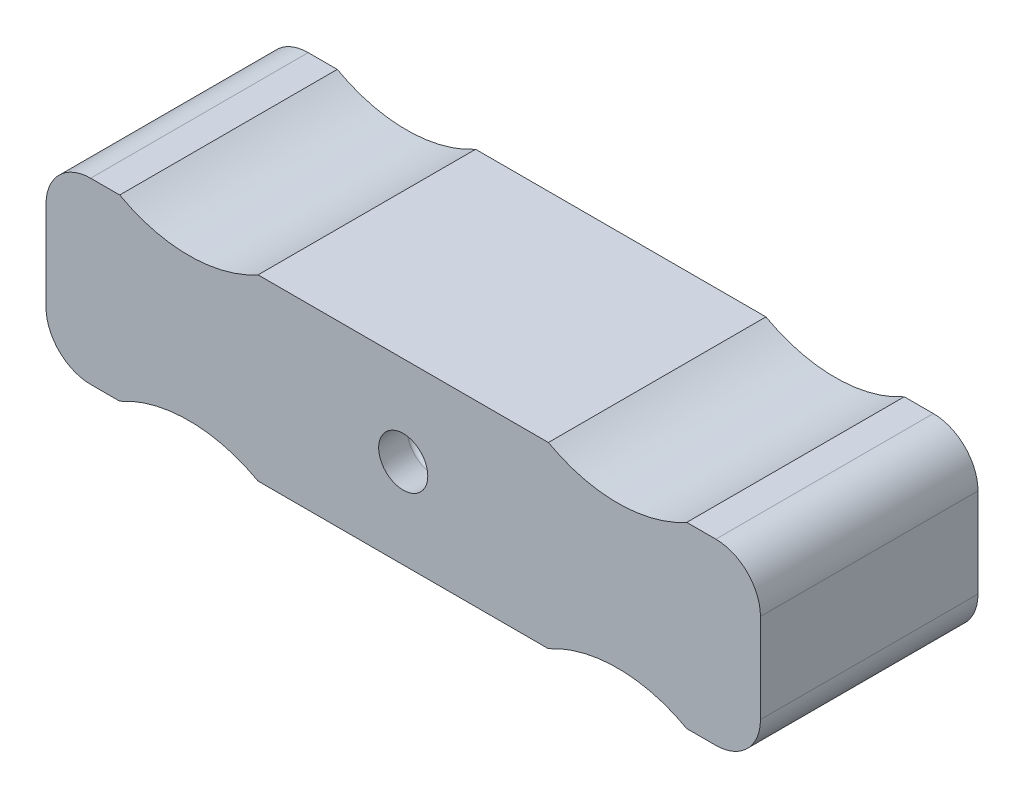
ISO-10303-21;
HEADER;
FILE_DESCRIPTION(('STEP AP214'),'2;1');
FILE_NAME('part.step','',(''),(''),'','','');
FILE_SCHEMA(('AUTOMOTIVE_DESIGN { 1 0 10303 214 1 1 1 1 }'));
ENDSEC;
DATA;
#1=APPLICATION_CONTEXT('core data for automotive mechanical design processes');
#2=APPLICATION_PROTOCOL_DEFINITION('international standard','automotive_design',2000,#1);
#3=PRODUCT_CONTEXT('',#1,'mechanical');
#4=PRODUCT('Part','Part','',(#3));
#5=PRODUCT_RELATED_PRODUCT_CATEGORY('part','',(#4));
#6=PRODUCT_DEFINITION_FORMATION('','',#4);
#7=PRODUCT_DEFINITION_CONTEXT('part definition',#1,'design');
#8=PRODUCT_DEFINITION('design','',#6,#7);
#9=PRODUCT_DEFINITION_SHAPE('','',#8);
#10=(LENGTH_UNIT() NAMED_UNIT(*) SI_UNIT(.MILLI.,.METRE.));
#11=(NAMED_UNIT(*) PLANE_ANGLE_UNIT() SI_UNIT($,.RADIAN.));
#12=(NAMED_UNIT(*) SI_UNIT($,.STERADIAN.) SOLID_ANGLE_UNIT());
#13=UNCERTAINTY_MEASURE_WITH_UNIT(LENGTH_MEASURE(1.E-05),#10,'distance_accuracy_value','');
#14=(GEOMETRIC_REPRESENTATION_CONTEXT(3) GLOBAL_UNCERTAINTY_ASSIGNED_CONTEXT((#13)) GLOBAL_UNIT_ASSIGNED_CONTEXT((#10,
#11,#12)) REPRESENTATION_CONTEXT('',''));
#15=CARTESIAN_POINT('',(0.,0.,0.));
#16=DIRECTION('',(0.,0.,1.));
#17=DIRECTION('',(1.,0.,0.));
#18=AXIS2_PLACEMENT_3D('',#15,#16,#17);
#19=CARTESIAN_POINT('',(63.0000000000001,100.,-20.));
#20=DIRECTION('',(0.,0.,1.));
#21=DIRECTION('',(1.,0.,0.));
#22=AXIS2_PLACEMENT_3D('',#19,#20,#21);
#23=PLANE('',#22);
#24=CARTESIAN_POINT('',(110.5,105.,-20.));
#25=DIRECTION('',(0.,0.,-1.));
#26=DIRECTION('',(-1.,0.,0.));
#27=AXIS2_PLACEMENT_3D('',#24,#25,#26);
#28=CIRCLE('',#27,3.);
#29=CARTESIAN_POINT('',(107.5,105.,-20.));
#30=VERTEX_POINT('',#29);
#31=EDGE_CURVE('E183',#30,#30,#28,.T.);
#32=ORIENTED_EDGE('',*,*,#31,.F.);
#33=EDGE_LOOP('',(#32));
#34=FACE_BOUND('',#33,.T.);
#35=CARTESIAN_POINT('',(63.0000000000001,100.,-20.));
#36=DIRECTION('',(0.,0.,1.));
#37=DIRECTION('',(1.,0.,0.));
#38=AXIS2_PLACEMENT_3D('',#35,#36,#37);
#39=CIRCLE('',#38,5.);
#40=CARTESIAN_POINT('',(58.0000000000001,100.,-20.));
#41=VERTEX_POINT('',#40);
#42=CARTESIAN_POINT('',(63.0000000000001,95.0000000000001,-20.));
#43=VERTEX_POINT('',#42);
#44=EDGE_CURVE('E235',#41,#43,#39,.T.);
#45=ORIENTED_EDGE('',*,*,#44,.F.);
#46=DIRECTION('',(0.,-1.,0.));
#47=VECTOR('',#46,1.);
#48=CARTESIAN_POINT('',(58.0000000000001,110.,-20.));
#49=LINE('',#48,#47);
#50=CARTESIAN_POINT('',(58.0000000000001,110.,-20.));
#51=VERTEX_POINT('',#50);
#52=EDGE_CURVE('E279',#51,#41,#49,.T.);
#53=ORIENTED_EDGE('',*,*,#52,.F.);
#54=CARTESIAN_POINT('',(63.0000000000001,110.,-20.));
#55=DIRECTION('',(0.,0.,1.));
#56=DIRECTION('',(1.,0.,0.));
#57=AXIS2_PLACEMENT_3D('',#54,#55,#56);
#58=CIRCLE('',#57,5.);
#59=CARTESIAN_POINT('',(63.0000000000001,115.,-20.));
#60=VERTEX_POINT('',#59);
#61=EDGE_CURVE('E277',#60,#51,#58,.T.);
#62=ORIENTED_EDGE('',*,*,#61,.F.);
#63=DIRECTION('',(-1.,0.,0.));
#64=VECTOR('',#63,1.);
#65=CARTESIAN_POINT('',(66.2540333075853,115.,-20.));
#66=LINE('',#65,#64);
#67=CARTESIAN_POINT('',(66.2540333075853,115.,-20.));
#68=VERTEX_POINT('',#67);
#69=EDGE_CURVE('E274',#68,#60,#66,.T.);
#70=ORIENTED_EDGE('',*,*,#69,.F.);
#71=CARTESIAN_POINT('',(74.,129.,-20.));
#72=DIRECTION('',(0.,0.,-1.));
#73=DIRECTION('',(1.,0.,0.));
#74=AXIS2_PLACEMENT_3D('',#71,#72,#73);
#75=CIRCLE('',#74,16.);
#76=CARTESIAN_POINT('',(81.7459666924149,115.,-20.));
#77=VERTEX_POINT('',#76);
#78=EDGE_CURVE('E271',#77,#68,#75,.T.);
#79=ORIENTED_EDGE('',*,*,#78,.F.);
#80=DIRECTION('',(-1.,0.,0.));
#81=VECTOR('',#80,1.);
#82=CARTESIAN_POINT('',(114.254033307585,115.,-20.));
#83=LINE('',#82,#81);
#84=CARTESIAN_POINT('',(114.254033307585,115.,-20.));
#85=VERTEX_POINT('',#84);
#86=EDGE_CURVE('E268',#85,#77,#83,.T.);
#87=ORIENTED_EDGE('',*,*,#86,.F.);
#88=CARTESIAN_POINT('',(122.,129.,-20.));
#89=DIRECTION('',(0.,0.,-1.));
#90=DIRECTION('',(1.,0.,0.));
#91=AXIS2_PLACEMENT_3D('',#88,#89,#90);
#92=CIRCLE('',#91,16.);
#93=CARTESIAN_POINT('',(129.745966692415,115.,-20.));
#94=VERTEX_POINT('',#93);
#95=EDGE_CURVE('E265',#94,#85,#92,.T.);
#96=ORIENTED_EDGE('',*,*,#95,.F.);
#97=DIRECTION('',(-1.,0.,0.));
#98=VECTOR('',#97,1.);
#99=CARTESIAN_POINT('',(133.,115.,-20.));
#100=LINE('',#99,#98);
#101=CARTESIAN_POINT('',(133.,115.,-20.));
#102=VERTEX_POINT('',#101);
#103=EDGE_CURVE('E262',#102,#94,#100,.T.);
#104=ORIENTED_EDGE('',*,*,#103,.F.);
#105=CARTESIAN_POINT('',(133.,110.,-20.));
#106=DIRECTION('',(0.,0.,1.));
#107=DIRECTION('',(1.,0.,0.));
#108=AXIS2_PLACEMENT_3D('',#105,#106,#107);
#109=CIRCLE('',#108,5.00000000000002);
#110=CARTESIAN_POINT('',(138.,110.,-20.));
#111=VERTEX_POINT('',#110);
#112=EDGE_CURVE('E259',#111,#102,#109,.T.);
#113=ORIENTED_EDGE('',*,*,#112,.F.);
#114=DIRECTION('',(0.,1.,0.));
#115=VECTOR('',#114,1.);
#116=CARTESIAN_POINT('',(138.,100.,-20.));
#117=LINE('',#116,#115);
#118=CARTESIAN_POINT('',(138.,100.,-20.));
#119=VERTEX_POINT('',#118);
#120=EDGE_CURVE('E256',#119,#111,#117,.T.);
#121=ORIENTED_EDGE('',*,*,#120,.F.);
#122=CARTESIAN_POINT('',(133.,100.,-20.));
#123=DIRECTION('',(0.,0.,1.));
#124=DIRECTION('',(1.,0.,0.));
#125=AXIS2_PLACEMENT_3D('',#122,#123,#124);
#126=CIRCLE('',#125,5.00000000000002);
#127=CARTESIAN_POINT('',(133.,95.0000000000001,-20.));
#128=VERTEX_POINT('',#127);
#129=EDGE_CURVE('E253',#128,#119,#126,.T.);
#130=ORIENTED_EDGE('',*,*,#129,.F.);
#131=DIRECTION('',(1.,0.,0.));
#132=VECTOR('',#131,1.);
#133=CARTESIAN_POINT('',(129.745966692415,95.0000000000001,-20.));
#134=LINE('',#133,#132);
#135=CARTESIAN_POINT('',(129.745966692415,95.0000000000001,-20.));
#136=VERTEX_POINT('',#135);
#137=EDGE_CURVE('E250',#136,#128,#134,.T.);
#138=ORIENTED_EDGE('',*,*,#137,.F.);
#139=CARTESIAN_POINT('',(122.,81.0000000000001,-20.));
#140=DIRECTION('',(0.,0.,-1.));
#141=DIRECTION('',(1.,0.,0.));
#142=AXIS2_PLACEMENT_3D('',#139,#140,#141);
#143=CIRCLE('',#142,16.);
#144=CARTESIAN_POINT('',(114.254033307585,95.0000000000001,-20.));
#145=VERTEX_POINT('',#144);
#146=EDGE_CURVE('E247',#145,#136,#143,.T.);
#147=ORIENTED_EDGE('',*,*,#146,.F.);
#148=DIRECTION('',(1.,0.,0.));
#149=VECTOR('',#148,1.);
#150=CARTESIAN_POINT('',(81.7459666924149,95.0000000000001,-20.));
#151=LINE('',#150,#149);
#152=CARTESIAN_POINT('',(81.7459666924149,95.0000000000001,-20.));
#153=VERTEX_POINT('',#152);
#154=EDGE_CURVE('E244',#153,#145,#151,.T.);
#155=ORIENTED_EDGE('',*,*,#154,.F.);
#156=CARTESIAN_POINT('',(74.,81.0000000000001,-20.));
#157=DIRECTION('',(0.,0.,-1.));
#158=DIRECTION('',(1.,0.,0.));
#159=AXIS2_PLACEMENT_3D('',#156,#157,#158);
#160=CIRCLE('',#159,16.);
#161=CARTESIAN_POINT('',(66.2540333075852,95.0000000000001,-20.));
#162=VERTEX_POINT('',#161);
#163=EDGE_CURVE('E241',#162,#153,#160,.T.);
#164=ORIENTED_EDGE('',*,*,#163,.F.);
#165=DIRECTION('',(1.,0.,0.));
#166=VECTOR('',#165,1.);
#167=CARTESIAN_POINT('',(63.0000000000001,95.0000000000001,-20.));
#168=LINE('',#167,#166);
#169=EDGE_CURVE('E238',#43,#162,#168,.T.);
#170=ORIENTED_EDGE('',*,*,#169,.F.);
#171=EDGE_LOOP('',(#45,#53,#62,#70,#79,#87,#96,#104,#113,#121,#130,#138,#147,#155,#164,#170));
#172=FACE_BOUND('',#171,.T.);
#173=CARTESIAN_POINT('',(98.0000000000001,105.,-20.));
#174=DIRECTION('',(0.,0.,1.));
#175=DIRECTION('',(1.,0.,0.));
#176=AXIS2_PLACEMENT_3D('',#173,#174,#175);
#177=CIRCLE('',#176,2.50000000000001);
#178=CARTESIAN_POINT('',(100.5,105.,-20.));
#179=VERTEX_POINT('',#178);
#180=EDGE_CURVE('E232',#179,#179,#177,.T.);
#181=ORIENTED_EDGE('',*,*,#180,.T.);
#182=EDGE_LOOP('',(#181));
#183=FACE_BOUND('',#182,.T.);
#184=CARTESIAN_POINT('',(85.5000000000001,105.,-20.));
#185=DIRECTION('',(0.,0.,-1.));
#186=DIRECTION('',(-1.,0.,0.));
#187=AXIS2_PLACEMENT_3D('',#184,#185,#186);
#188=CIRCLE('',#187,3.);
#189=CARTESIAN_POINT('',(82.5000000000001,105.,-20.));
#190=VERTEX_POINT('',#189);
#191=EDGE_CURVE('E171',#190,#190,#188,.T.);
#192=ORIENTED_EDGE('',*,*,#191,.F.);
#193=EDGE_LOOP('',(#192));
#194=FACE_BOUND('',#193,.T.);
#195=ADVANCED_FACE('F31',(#34,#172,#183,#194),#23,.F.);
#196=CARTESIAN_POINT('',(58.0000000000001,110.,86.8221125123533));
#197=DIRECTION('',(1.,0.,0.));
#198=DIRECTION('',(0.,0.,-1.));
#199=AXIS2_PLACEMENT_3D('',#196,#197,#198);
#200=PLANE('',#199);
#201=DIRECTION('',(0.,-1.,0.));
#202=VECTOR('',#201,1.);
#203=CARTESIAN_POINT('',(58.0000000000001,110.,4.36));
#204=LINE('',#203,#202);
#205=CARTESIAN_POINT('',(58.0000000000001,110.,4.36));
#206=VERTEX_POINT('',#205);
#207=CARTESIAN_POINT('',(58.,100.,4.36));
#208=VERTEX_POINT('',#207);
#209=EDGE_CURVE('E186',#206,#208,#204,.T.);
#210=ORIENTED_EDGE('',*,*,#209,.F.);
#211=DIRECTION('',(0.,0.,-1.));
#212=VECTOR('',#211,1.);
#213=CARTESIAN_POINT('',(58.0000000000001,110.,86.8221125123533));
#214=LINE('',#213,#212);
#215=EDGE_CURVE('E47',#206,#51,#214,.T.);
#216=ORIENTED_EDGE('',*,*,#215,.T.);
#217=ORIENTED_EDGE('',*,*,#52,.T.);
#218=DIRECTION('',(0.,0.,-1.));
#219=VECTOR('',#218,1.);
#220=CARTESIAN_POINT('',(58.0000000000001,100.,86.8221125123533));
#221=LINE('',#220,#219);
#222=EDGE_CURVE('E282',#208,#41,#221,.T.);
#223=ORIENTED_EDGE('',*,*,#222,.F.);
#224=EDGE_LOOP('',(#210,#216,#217,#223));
#225=FACE_BOUND('',#224,.T.);
#226=ADVANCED_FACE('F332',(#225),#200,.F.);
#227=CARTESIAN_POINT('',(63.,110.,86.8221125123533));
#228=DIRECTION('',(0.,0.,-1.));
#229=DIRECTION('',(-1.,0.,0.));
#230=AXIS2_PLACEMENT_3D('',#227,#228,#229);
#231=CYLINDRICAL_SURFACE('',#230,5.);
#232=CARTESIAN_POINT('',(63.0000000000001,110.,4.36000000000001));
#233=DIRECTION('',(0.,0.,1.));
#234=DIRECTION('',(1.,0.,0.));
#235=AXIS2_PLACEMENT_3D('',#232,#233,#234);
#236=CIRCLE('',#235,5.);
#237=CARTESIAN_POINT('',(63.0000000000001,115.,4.36000000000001));
#238=VERTEX_POINT('',#237);
#239=EDGE_CURVE('E189',#238,#206,#236,.T.);
#240=ORIENTED_EDGE('',*,*,#239,.F.);
#241=DIRECTION('',(0.,0.,-1.));
#242=VECTOR('',#241,1.);
#243=CARTESIAN_POINT('',(63.,115.,86.8221125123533));
#244=LINE('',#243,#242);
#245=EDGE_CURVE('E285',#238,#60,#244,.T.);
#246=ORIENTED_EDGE('',*,*,#245,.T.);
#247=ORIENTED_EDGE('',*,*,#61,.T.);
#248=ORIENTED_EDGE('',*,*,#215,.F.);
#249=EDGE_LOOP('',(#240,#246,#247,#248));
#250=FACE_BOUND('',#249,.T.);
#251=ADVANCED_FACE('F333',(#250),#231,.T.);
#252=CARTESIAN_POINT('',(66.2540333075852,115.,86.8221125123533));
#253=DIRECTION('',(0.,-1.,0.));
#254=DIRECTION('',(0.,0.,-1.));
#255=AXIS2_PLACEMENT_3D('',#252,#253,#254);
#256=PLANE('',#255);
#257=DIRECTION('',(-1.,0.,0.));
#258=VECTOR('',#257,1.);
#259=CARTESIAN_POINT('',(66.2540333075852,115.,4.36));
#260=LINE('',#259,#258);
#261=CARTESIAN_POINT('',(66.2540333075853,115.,4.36));
#262=VERTEX_POINT('',#261);
#263=EDGE_CURVE('E192',#262,#238,#260,.T.);
#264=ORIENTED_EDGE('',*,*,#263,.F.);
#265=DIRECTION('',(0.,0.,-1.));
#266=VECTOR('',#265,1.);
#267=CARTESIAN_POINT('',(66.2540333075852,115.,86.8221125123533));
#268=LINE('',#267,#266);
#269=EDGE_CURVE('E287',#262,#68,#268,.T.);
#270=ORIENTED_EDGE('',*,*,#269,.T.);
#271=ORIENTED_EDGE('',*,*,#69,.T.);
#272=ORIENTED_EDGE('',*,*,#245,.F.);
#273=EDGE_LOOP('',(#264,#270,#271,#272));
#274=FACE_BOUND('',#273,.T.);
#275=ADVANCED_FACE('F336',(#274),#256,.F.);
#276=CARTESIAN_POINT('',(74.0000000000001,129.,86.8221125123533));
#277=DIRECTION('',(0.,0.,-1.));
#278=DIRECTION('',(-1.,0.,0.));
#279=AXIS2_PLACEMENT_3D('',#276,#277,#278);
#280=CYLINDRICAL_SURFACE('',#279,16.);
#281=CARTESIAN_POINT('',(74.0000000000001,129.,4.36000000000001));
#282=DIRECTION('',(0.,0.,1.));
#283=DIRECTION('',(1.,0.,0.));
#284=AXIS2_PLACEMENT_3D('',#281,#282,#283);
#285=CIRCLE('',#284,16.);
#286=CARTESIAN_POINT('',(81.7459666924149,115.,4.36));
#287=VERTEX_POINT('',#286);
#288=EDGE_CURVE('E195',#287,#262,#285,.F.);
#289=ORIENTED_EDGE('',*,*,#288,.F.);
#290=DIRECTION('',(0.,0.,-1.));
#291=VECTOR('',#290,1.);
#292=CARTESIAN_POINT('',(81.7459666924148,115.,86.8221125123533));
#293=LINE('',#292,#291);
#294=EDGE_CURVE('E289',#287,#77,#293,.T.);
#295=ORIENTED_EDGE('',*,*,#294,.T.);
#296=ORIENTED_EDGE('',*,*,#78,.T.);
#297=ORIENTED_EDGE('',*,*,#269,.F.);
#298=EDGE_LOOP('',(#289,#295,#296,#297));
#299=FACE_BOUND('',#298,.T.);
#300=ADVANCED_FACE('F342',(#299),#280,.F.);
#301=CARTESIAN_POINT('',(114.254033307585,115.,86.8221125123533));
#302=DIRECTION('',(0.,-1.,0.));
#303=DIRECTION('',(0.,0.,-1.));
#304=AXIS2_PLACEMENT_3D('',#301,#302,#303);
#305=PLANE('',#304);
#306=DIRECTION('',(-1.,0.,0.));
#307=VECTOR('',#306,1.);
#308=CARTESIAN_POINT('',(114.254033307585,115.,4.36000000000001));
#309=LINE('',#308,#307);
#310=CARTESIAN_POINT('',(114.254033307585,115.,4.36000000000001));
#311=VERTEX_POINT('',#310);
#312=EDGE_CURVE('E198',#311,#287,#309,.T.);
#313=ORIENTED_EDGE('',*,*,#312,.F.);
#314=DIRECTION('',(0.,0.,-1.));
#315=VECTOR('',#314,1.);
#316=CARTESIAN_POINT('',(114.254033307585,115.,86.8221125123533));
#317=LINE('',#316,#315);
#318=EDGE_CURVE('E291',#311,#85,#317,.T.);
#319=ORIENTED_EDGE('',*,*,#318,.T.);
#320=ORIENTED_EDGE('',*,*,#86,.T.);
#321=ORIENTED_EDGE('',*,*,#294,.F.);
#322=EDGE_LOOP('',(#313,#319,#320,#321));
#323=FACE_BOUND('',#322,.T.);
#324=ADVANCED_FACE('F345',(#323),#305,.F.);
#325=CARTESIAN_POINT('',(122.,129.,86.8221125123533));
#326=DIRECTION('',(0.,0.,-1.));
#327=DIRECTION('',(-1.,0.,0.));
#328=AXIS2_PLACEMENT_3D('',#325,#326,#327);
#329=CYLINDRICAL_SURFACE('',#328,16.);
#330=CARTESIAN_POINT('',(122.,129.,4.36));
#331=DIRECTION('',(0.,0.,1.));
#332=DIRECTION('',(1.,0.,0.));
#333=AXIS2_PLACEMENT_3D('',#330,#331,#332);
#334=CIRCLE('',#333,16.);
#335=CARTESIAN_POINT('',(129.745966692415,115.,4.36000000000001));
#336=VERTEX_POINT('',#335);
#337=EDGE_CURVE('E201',#336,#311,#334,.F.);
#338=ORIENTED_EDGE('',*,*,#337,.F.);
#339=DIRECTION('',(0.,0.,-1.));
#340=VECTOR('',#339,1.);
#341=CARTESIAN_POINT('',(129.745966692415,115.,86.8221125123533));
#342=LINE('',#341,#340);
#343=EDGE_CURVE('E293',#336,#94,#342,.T.);
#344=ORIENTED_EDGE('',*,*,#343,.T.);
#345=ORIENTED_EDGE('',*,*,#95,.T.);
#346=ORIENTED_EDGE('',*,*,#318,.F.);
#347=EDGE_LOOP('',(#338,#344,#345,#346));
#348=FACE_BOUND('',#347,.T.);
#349=ADVANCED_FACE('F348',(#348),#329,.F.);
#350=CARTESIAN_POINT('',(133.,115.,86.8221125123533));
#351=DIRECTION('',(0.,-1.,0.));
#352=DIRECTION('',(0.,0.,-1.));
#353=AXIS2_PLACEMENT_3D('',#350,#351,#352);
#354=PLANE('',#353);
#355=DIRECTION('',(-1.,0.,0.));
#356=VECTOR('',#355,1.);
#357=CARTESIAN_POINT('',(133.,115.,4.36));
#358=LINE('',#357,#356);
#359=CARTESIAN_POINT('',(133.,115.,4.36));
#360=VERTEX_POINT('',#359);
#361=EDGE_CURVE('E204',#360,#336,#358,.T.);
#362=ORIENTED_EDGE('',*,*,#361,.F.);
#363=DIRECTION('',(0.,0.,-1.));
#364=VECTOR('',#363,1.);
#365=CARTESIAN_POINT('',(133.,115.,86.8221125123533));
#366=LINE('',#365,#364);
#367=EDGE_CURVE('E295',#360,#102,#366,.T.);
#368=ORIENTED_EDGE('',*,*,#367,.T.);
#369=ORIENTED_EDGE('',*,*,#103,.T.);
#370=ORIENTED_EDGE('',*,*,#343,.F.);
#371=EDGE_LOOP('',(#362,#368,#369,#370));
#372=FACE_BOUND('',#371,.T.);
#373=ADVANCED_FACE('F354',(#372),#354,.F.);
#374=CARTESIAN_POINT('',(133.,110.,86.8221125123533));
#375=DIRECTION('',(0.,0.,-1.));
#376=DIRECTION('',(-1.,0.,0.));
#377=AXIS2_PLACEMENT_3D('',#374,#375,#376);
#378=CYLINDRICAL_SURFACE('',#377,5.00000000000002);
#379=CARTESIAN_POINT('',(133.,110.,4.36));
#380=DIRECTION('',(0.,0.,1.));
#381=DIRECTION('',(1.,0.,0.));
#382=AXIS2_PLACEMENT_3D('',#379,#380,#381);
#383=CIRCLE('',#382,5.00000000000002);
#384=CARTESIAN_POINT('',(138.,110.,4.36000000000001));
#385=VERTEX_POINT('',#384);
#386=EDGE_CURVE('E207',#385,#360,#383,.T.);
#387=ORIENTED_EDGE('',*,*,#386,.F.);
#388=DIRECTION('',(0.,0.,-1.));
#389=VECTOR('',#388,1.);
#390=CARTESIAN_POINT('',(138.,110.,86.8221125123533));
#391=LINE('',#390,#389);
#392=EDGE_CURVE('E297',#385,#111,#391,.T.);
#393=ORIENTED_EDGE('',*,*,#392,.T.);
#394=ORIENTED_EDGE('',*,*,#112,.T.);
#395=ORIENTED_EDGE('',*,*,#367,.F.);
#396=EDGE_LOOP('',(#387,#393,#394,#395));
#397=FACE_BOUND('',#396,.T.);
#398=ADVANCED_FACE('F357',(#397),#378,.T.);
#399=CARTESIAN_POINT('',(138.,100.,86.8221125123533));
#400=DIRECTION('',(-1.,0.,0.));
#401=DIRECTION('',(0.,0.,1.));
#402=AXIS2_PLACEMENT_3D('',#399,#400,#401);
#403=PLANE('',#402);
#404=DIRECTION('',(0.,1.,0.));
#405=VECTOR('',#404,1.);
#406=CARTESIAN_POINT('',(138.,100.,4.36000000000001));
#407=LINE('',#406,#405);
#408=CARTESIAN_POINT('',(138.,100.,4.36000000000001));
#409=VERTEX_POINT('',#408);
#410=EDGE_CURVE('E210',#409,#385,#407,.T.);
#411=ORIENTED_EDGE('',*,*,#410,.F.);
#412=DIRECTION('',(0.,0.,-1.));
#413=VECTOR('',#412,1.);
#414=CARTESIAN_POINT('',(138.,100.,86.8221125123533));
#415=LINE('',#414,#413);
#416=EDGE_CURVE('E299',#409,#119,#415,.T.);
#417=ORIENTED_EDGE('',*,*,#416,.T.);
#418=ORIENTED_EDGE('',*,*,#120,.T.);
#419=ORIENTED_EDGE('',*,*,#392,.F.);
#420=EDGE_LOOP('',(#411,#417,#418,#419));
#421=FACE_BOUND('',#420,.T.);
#422=ADVANCED_FACE('F360',(#421),#403,.F.);
#423=CARTESIAN_POINT('',(133.,100.,86.8221125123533));
#424=DIRECTION('',(0.,0.,-1.));
#425=DIRECTION('',(-1.,0.,0.));
#426=AXIS2_PLACEMENT_3D('',#423,#424,#425);
#427=CYLINDRICAL_SURFACE('',#426,5.00000000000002);
#428=CARTESIAN_POINT('',(133.,100.,4.36));
#429=DIRECTION('',(0.,0.,1.));
#430=DIRECTION('',(1.,0.,0.));
#431=AXIS2_PLACEMENT_3D('',#428,#429,#430);
#432=CIRCLE('',#431,5.00000000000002);
#433=CARTESIAN_POINT('',(133.,95.0000000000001,4.36));
#434=VERTEX_POINT('',#433);
#435=EDGE_CURVE('E213',#434,#409,#432,.T.);
#436=ORIENTED_EDGE('',*,*,#435,.F.);
#437=DIRECTION('',(0.,0.,-1.));
#438=VECTOR('',#437,1.);
#439=CARTESIAN_POINT('',(133.,95.0000000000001,86.8221125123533));
#440=LINE('',#439,#438);
#441=EDGE_CURVE('E301',#434,#128,#440,.T.);
#442=ORIENTED_EDGE('',*,*,#441,.T.);
#443=ORIENTED_EDGE('',*,*,#129,.T.);
#444=ORIENTED_EDGE('',*,*,#416,.F.);
#445=EDGE_LOOP('',(#436,#442,#443,#444));
#446=FACE_BOUND('',#445,.T.);
#447=ADVANCED_FACE('F364',(#446),#427,.T.);
#448=CARTESIAN_POINT('',(129.745966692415,95.0000000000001,86.8221125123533));
#449=DIRECTION('',(0.,1.,0.));
#450=DIRECTION('',(0.,0.,1.));
#451=AXIS2_PLACEMENT_3D('',#448,#449,#450);
#452=PLANE('',#451);
#453=DIRECTION('',(1.,0.,0.));
#454=VECTOR('',#453,1.);
#455=CARTESIAN_POINT('',(129.745966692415,95.0000000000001,4.36));
#456=LINE('',#455,#454);
#457=CARTESIAN_POINT('',(129.745966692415,95.0000000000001,4.36));
#458=VERTEX_POINT('',#457);
#459=EDGE_CURVE('E216',#458,#434,#456,.T.);
#460=ORIENTED_EDGE('',*,*,#459,.F.);
#461=DIRECTION('',(0.,0.,-1.));
#462=VECTOR('',#461,1.);
#463=CARTESIAN_POINT('',(129.745966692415,95.0000000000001,86.8221125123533));
#464=LINE('',#463,#462);
#465=EDGE_CURVE('E303',#458,#136,#464,.T.);
#466=ORIENTED_EDGE('',*,*,#465,.T.);
#467=ORIENTED_EDGE('',*,*,#137,.T.);
#468=ORIENTED_EDGE('',*,*,#441,.F.);
#469=EDGE_LOOP('',(#460,#466,#467,#468));
#470=FACE_BOUND('',#469,.T.);
#471=ADVANCED_FACE('F367',(#470),#452,.F.);
#472=CARTESIAN_POINT('',(122.,81.0000000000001,86.8221125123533));
#473=DIRECTION('',(0.,0.,-1.));
#474=DIRECTION('',(-1.,0.,0.));
#475=AXIS2_PLACEMENT_3D('',#472,#473,#474);
#476=CYLINDRICAL_SURFACE('',#475,16.);
#477=CARTESIAN_POINT('',(122.,81.0000000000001,4.36000000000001));
#478=DIRECTION('',(0.,0.,1.));
#479=DIRECTION('',(1.,0.,0.));
#480=AXIS2_PLACEMENT_3D('',#477,#478,#479);
#481=CIRCLE('',#480,16.);
#482=CARTESIAN_POINT('',(114.254033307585,95.0000000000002,4.36));
#483=VERTEX_POINT('',#482);
#484=EDGE_CURVE('E219',#483,#458,#481,.F.);
#485=ORIENTED_EDGE('',*,*,#484,.F.);
#486=DIRECTION('',(0.,0.,-1.));
#487=VECTOR('',#486,1.);
#488=CARTESIAN_POINT('',(114.254033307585,95.0000000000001,86.8221125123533));
#489=LINE('',#488,#487);
#490=EDGE_CURVE('E305',#483,#145,#489,.T.);
#491=ORIENTED_EDGE('',*,*,#490,.T.);
#492=ORIENTED_EDGE('',*,*,#146,.T.);
#493=ORIENTED_EDGE('',*,*,#465,.F.);
#494=EDGE_LOOP('',(#485,#491,#492,#493));
#495=FACE_BOUND('',#494,.T.);
#496=ADVANCED_FACE('F370',(#495),#476,.F.);
#497=CARTESIAN_POINT('',(81.745966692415,95.0000000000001,86.8221125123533));
#498=DIRECTION('',(0.,1.,0.));
#499=DIRECTION('',(-1.,0.,0.));
#500=AXIS2_PLACEMENT_3D('',#497,#498,#499);
#501=PLANE('',#500);
#502=DIRECTION('',(1.,0.,0.));
#503=VECTOR('',#502,1.);
#504=CARTESIAN_POINT('',(81.7459666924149,95.0000000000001,4.36));
#505=LINE('',#504,#503);
#506=CARTESIAN_POINT('',(81.7459666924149,95.0000000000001,4.36));
#507=VERTEX_POINT('',#506);
#508=EDGE_CURVE('E222',#507,#483,#505,.T.);
#509=ORIENTED_EDGE('',*,*,#508,.F.);
#510=DIRECTION('',(0.,0.,-1.));
#511=VECTOR('',#510,1.);
#512=CARTESIAN_POINT('',(81.745966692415,95.0000000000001,86.8221125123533));
#513=LINE('',#512,#511);
#514=EDGE_CURVE('E307',#507,#153,#513,.T.);
#515=ORIENTED_EDGE('',*,*,#514,.T.);
#516=ORIENTED_EDGE('',*,*,#154,.T.);
#517=ORIENTED_EDGE('',*,*,#490,.F.);
#518=EDGE_LOOP('',(#509,#515,#516,#517));
#519=FACE_BOUND('',#518,.T.);
#520=ADVANCED_FACE('F323',(#519),#501,.F.);
#521=CARTESIAN_POINT('',(74.0000000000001,81.0000000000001,86.8221125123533));
#522=DIRECTION('',(0.,0.,-1.));
#523=DIRECTION('',(-1.,0.,0.));
#524=AXIS2_PLACEMENT_3D('',#521,#522,#523);
#525=CYLINDRICAL_SURFACE('',#524,16.);
#526=CARTESIAN_POINT('',(74.,81.0000000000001,4.36000000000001));
#527=DIRECTION('',(0.,0.,1.));
#528=DIRECTION('',(1.,0.,0.));
#529=AXIS2_PLACEMENT_3D('',#526,#527,#528);
#530=CIRCLE('',#529,16.);
#531=CARTESIAN_POINT('',(66.2540333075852,95.0000000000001,4.36));
#532=VERTEX_POINT('',#531);
#533=EDGE_CURVE('E225',#532,#507,#530,.F.);
#534=ORIENTED_EDGE('',*,*,#533,.F.);
#535=DIRECTION('',(0.,0.,-1.));
#536=VECTOR('',#535,1.);
#537=CARTESIAN_POINT('',(66.2540333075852,95.0000000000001,86.8221125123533));
#538=LINE('',#537,#536);
#539=EDGE_CURVE('E40',#532,#162,#538,.T.);
#540=ORIENTED_EDGE('',*,*,#539,.T.);
#541=ORIENTED_EDGE('',*,*,#163,.T.);
#542=ORIENTED_EDGE('',*,*,#514,.F.);
#543=EDGE_LOOP('',(#534,#540,#541,#542));
#544=FACE_BOUND('',#543,.T.);
#545=ADVANCED_FACE('F310',(#544),#525,.F.);
#546=CARTESIAN_POINT('',(63.0000000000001,95.0000000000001,86.8221125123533));
#547=DIRECTION('',(0.,1.,0.));
#548=DIRECTION('',(0.,0.,1.));
#549=AXIS2_PLACEMENT_3D('',#546,#547,#548);
#550=PLANE('',#549);
#551=DIRECTION('',(1.,0.,0.));
#552=VECTOR('',#551,1.);
#553=CARTESIAN_POINT('',(63.,95.0000000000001,4.36));
#554=LINE('',#553,#552);
#555=CARTESIAN_POINT('',(63.0000000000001,95.0000000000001,4.36));
#556=VERTEX_POINT('',#555);
#557=EDGE_CURVE('E54',#556,#532,#554,.T.);
#558=ORIENTED_EDGE('',*,*,#557,.F.);
#559=DIRECTION('',(0.,0.,-1.));
#560=VECTOR('',#559,1.);
#561=CARTESIAN_POINT('',(63.0000000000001,95.0000000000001,86.8221125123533));
#562=LINE('',#561,#560);
#563=EDGE_CURVE('E11',#556,#43,#562,.T.);
#564=ORIENTED_EDGE('',*,*,#563,.T.);
#565=ORIENTED_EDGE('',*,*,#169,.T.);
#566=ORIENTED_EDGE('',*,*,#539,.F.);
#567=EDGE_LOOP('',(#558,#564,#565,#566));
#568=FACE_BOUND('',#567,.T.);
#569=ADVANCED_FACE('F315',(#568),#550,.F.);
#570=CARTESIAN_POINT('',(63.,100.,86.8221125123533));
#571=DIRECTION('',(0.,0.,-1.));
#572=DIRECTION('',(-1.,0.,0.));
#573=AXIS2_PLACEMENT_3D('',#570,#571,#572);
#574=CYLINDRICAL_SURFACE('',#573,5.);
#575=CARTESIAN_POINT('',(63.0000000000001,100.,4.36000000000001));
#576=DIRECTION('',(0.,0.,1.));
#577=DIRECTION('',(1.,0.,0.));
#578=AXIS2_PLACEMENT_3D('',#575,#576,#577);
#579=CIRCLE('',#578,5.);
#580=EDGE_CURVE('E229',#208,#556,#579,.T.);
#581=ORIENTED_EDGE('',*,*,#580,.F.);
#582=ORIENTED_EDGE('',*,*,#222,.T.);
#583=ORIENTED_EDGE('',*,*,#44,.T.);
#584=ORIENTED_EDGE('',*,*,#563,.F.);
#585=EDGE_LOOP('',(#581,#582,#583,#584));
#586=FACE_BOUND('',#585,.T.);
#587=ADVANCED_FACE('F33',(#586),#574,.T.);
#588=CARTESIAN_POINT('',(98.,105.,86.8221125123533));
#589=DIRECTION('',(0.,0.,-1.));
#590=DIRECTION('',(-1.,0.,0.));
#591=AXIS2_PLACEMENT_3D('',#588,#589,#590);
#592=CYLINDRICAL_SURFACE('',#591,2.50000000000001);
#593=CARTESIAN_POINT('',(98.,105.,0.359999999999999));
#594=DIRECTION('',(0.,0.,-1.));
#595=DIRECTION('',(-1.,0.,0.));
#596=AXIS2_PLACEMENT_3D('',#593,#594,#595);
#597=CIRCLE('',#596,2.50000000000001);
#598=CARTESIAN_POINT('',(95.5,105.,0.359999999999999));
#599=VERTEX_POINT('',#598);
#600=EDGE_CURVE('E35',#599,#599,#597,.T.);
#601=ORIENTED_EDGE('',*,*,#600,.F.);
#602=EDGE_LOOP('',(#601));
#603=FACE_BOUND('',#602,.T.);
#604=ORIENTED_EDGE('',*,*,#180,.F.);
#605=EDGE_LOOP('',(#604));
#606=FACE_BOUND('',#605,.T.);
#607=ADVANCED_FACE('F388',(#603,#606),#592,.F.);
#608=CARTESIAN_POINT('',(72.8381821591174,119.571310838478,4.36000000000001));
#609=DIRECTION('',(0.,0.,1.));
#610=DIRECTION('',(0.,-1.,0.));
#611=AXIS2_PLACEMENT_3D('',#608,#609,#610);
#612=PLANE('',#611);
#613=CARTESIAN_POINT('',(98.0000000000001,105.,4.36));
#614=DIRECTION('',(0.,0.,1.));
#615=DIRECTION('',(1.,0.,0.));
#616=AXIS2_PLACEMENT_3D('',#613,#614,#615);
#617=CIRCLE('',#616,2.75);
#618=CARTESIAN_POINT('',(100.75,105.,4.36));
#619=VERTEX_POINT('',#618);
#620=EDGE_CURVE('E165',#619,#619,#617,.T.);
#621=ORIENTED_EDGE('',*,*,#620,.F.);
#622=EDGE_LOOP('',(#621));
#623=FACE_BOUND('',#622,.T.);
#624=ORIENTED_EDGE('',*,*,#209,.T.);
#625=ORIENTED_EDGE('',*,*,#580,.T.);
#626=ORIENTED_EDGE('',*,*,#557,.T.);
#627=ORIENTED_EDGE('',*,*,#533,.T.);
#628=ORIENTED_EDGE('',*,*,#508,.T.);
#629=ORIENTED_EDGE('',*,*,#484,.T.);
#630=ORIENTED_EDGE('',*,*,#459,.T.);
#631=ORIENTED_EDGE('',*,*,#435,.T.);
#632=ORIENTED_EDGE('',*,*,#410,.T.);
#633=ORIENTED_EDGE('',*,*,#386,.T.);
#634=ORIENTED_EDGE('',*,*,#361,.T.);
#635=ORIENTED_EDGE('',*,*,#337,.T.);
#636=ORIENTED_EDGE('',*,*,#312,.T.);
#637=ORIENTED_EDGE('',*,*,#288,.T.);
#638=ORIENTED_EDGE('',*,*,#263,.T.);
#639=ORIENTED_EDGE('',*,*,#239,.T.);
#640=EDGE_LOOP('',(#624,#625,#626,#627,#628,#629,#630,#631,#632,#633,#634,#635,#636,#637,#638,#639));
#641=FACE_BOUND('',#640,.T.);
#642=ADVANCED_FACE('F325',(#623,#641),#612,.T.);
#643=CARTESIAN_POINT('',(110.5,105.,-20.));
#644=DIRECTION('',(0.,0.,-1.));
#645=DIRECTION('',(-1.,0.,0.));
#646=AXIS2_PLACEMENT_3D('',#643,#644,#645);
#647=CYLINDRICAL_SURFACE('',#646,3.);
#648=CARTESIAN_POINT('',(110.5,105.,-5.));
#649=DIRECTION('',(0.,0.,-1.));
#650=DIRECTION('',(-1.,0.,0.));
#651=AXIS2_PLACEMENT_3D('',#648,#649,#650);
#652=CIRCLE('',#651,3.);
#653=CARTESIAN_POINT('',(107.5,105.,-5.));
#654=VERTEX_POINT('',#653);
#655=EDGE_CURVE('E180',#654,#654,#652,.T.);
#656=ORIENTED_EDGE('',*,*,#655,.F.);
#657=EDGE_LOOP('',(#656));
#658=FACE_BOUND('',#657,.T.);
#659=ORIENTED_EDGE('',*,*,#31,.T.);
#660=EDGE_LOOP('',(#659));
#661=FACE_BOUND('',#660,.T.);
#662=ADVANCED_FACE('F465',(#658,#661),#647,.F.);
#663=CARTESIAN_POINT('',(113.,105.,-5.00000000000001));
#664=DIRECTION('',(0.,0.,1.));
#665=DIRECTION('',(1.,0.,0.));
#666=AXIS2_PLACEMENT_3D('',#663,#664,#665);
#667=PLANE('',#666);
#668=CARTESIAN_POINT('',(110.5,105.,-5.));
#669=DIRECTION('',(0.,0.,-1.));
#670=DIRECTION('',(-1.,0.,0.));
#671=AXIS2_PLACEMENT_3D('',#668,#669,#670);
#672=CIRCLE('',#671,2.5);
#673=CARTESIAN_POINT('',(108.,105.,-5.));
#674=VERTEX_POINT('',#673);
#675=EDGE_CURVE('E177',#674,#674,#672,.T.);
#676=ORIENTED_EDGE('',*,*,#675,.F.);
#677=EDGE_LOOP('',(#676));
#678=FACE_BOUND('',#677,.T.);
#679=ORIENTED_EDGE('',*,*,#655,.T.);
#680=EDGE_LOOP('',(#679));
#681=FACE_BOUND('',#680,.T.);
#682=ADVANCED_FACE('F475',(#678,#681),#667,.F.);
#683=CARTESIAN_POINT('',(110.5,105.,-20.));
#684=DIRECTION('',(0.,0.,-1.));
#685=DIRECTION('',(-1.,0.,0.));
#686=AXIS2_PLACEMENT_3D('',#683,#684,#685);
#687=CYLINDRICAL_SURFACE('',#686,2.5);
#688=CARTESIAN_POINT('',(110.5,105.,-2.));
#689=DIRECTION('',(0.,0.,-1.));
#690=DIRECTION('',(-1.,0.,0.));
#691=AXIS2_PLACEMENT_3D('',#688,#689,#690);
#692=CIRCLE('',#691,2.5);
#693=CARTESIAN_POINT('',(108.,105.,-2.));
#694=VERTEX_POINT('',#693);
#695=EDGE_CURVE('E174',#694,#694,#692,.T.);
#696=ORIENTED_EDGE('',*,*,#695,.F.);
#697=EDGE_LOOP('',(#696));
#698=FACE_BOUND('',#697,.T.);
#699=ORIENTED_EDGE('',*,*,#675,.T.);
#700=EDGE_LOOP('',(#699));
#701=FACE_BOUND('',#700,.T.);
#702=ADVANCED_FACE('F485',(#698,#701),#687,.F.);
#703=CARTESIAN_POINT('',(110.5,105.,-2.));
#704=DIRECTION('',(0.,0.,-1.));
#705=DIRECTION('',(-1.,0.,0.));
#706=AXIS2_PLACEMENT_3D('',#703,#704,#705);
#707=CONICAL_SURFACE('',#706,2.5,1.02974425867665);
#708=CARTESIAN_POINT('',(110.5,105.,-0.497848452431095));
#709=VERTEX_POINT('',#708);
#710=VERTEX_LOOP('',#709);
#711=FACE_BOUND('',#710,.T.);
#712=ORIENTED_EDGE('',*,*,#695,.T.);
#713=EDGE_LOOP('',(#712));
#714=FACE_BOUND('',#713,.T.);
#715=ADVANCED_FACE('F495',(#711,#714),#707,.F.);
#716=CARTESIAN_POINT('',(85.5000000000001,105.,-20.));
#717=DIRECTION('',(0.,0.,-1.));
#718=DIRECTION('',(-1.,0.,0.));
#719=AXIS2_PLACEMENT_3D('',#716,#717,#718);
#720=CYLINDRICAL_SURFACE('',#719,3.);
#721=CARTESIAN_POINT('',(85.5,105.,-5.));
#722=DIRECTION('',(0.,0.,-1.));
#723=DIRECTION('',(-1.,0.,0.));
#724=AXIS2_PLACEMENT_3D('',#721,#722,#723);
#725=CIRCLE('',#724,3.);
#726=CARTESIAN_POINT('',(82.5,105.,-5.));
#727=VERTEX_POINT('',#726);
#728=EDGE_CURVE('E162',#727,#727,#725,.T.);
#729=ORIENTED_EDGE('',*,*,#728,.F.);
#730=EDGE_LOOP('',(#729));
#731=FACE_BOUND('',#730,.T.);
#732=ORIENTED_EDGE('',*,*,#191,.T.);
#733=EDGE_LOOP('',(#732));
#734=FACE_BOUND('',#733,.T.);
#735=ADVANCED_FACE('F505',(#731,#734),#720,.F.);
#736=CARTESIAN_POINT('',(88.,105.,-5.00000000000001));
#737=DIRECTION('',(0.,0.,1.));
#738=DIRECTION('',(1.,0.,0.));
#739=AXIS2_PLACEMENT_3D('',#736,#737,#738);
#740=PLANE('',#739);
#741=CARTESIAN_POINT('',(85.5,105.,-5.));
#742=DIRECTION('',(0.,0.,-1.));
#743=DIRECTION('',(-1.,0.,0.));
#744=AXIS2_PLACEMENT_3D('',#741,#742,#743);
#745=CIRCLE('',#744,2.5);
#746=CARTESIAN_POINT('',(83.,105.,-5.));
#747=VERTEX_POINT('',#746);
#748=EDGE_CURVE('E159',#747,#747,#745,.T.);
#749=ORIENTED_EDGE('',*,*,#748,.F.);
#750=EDGE_LOOP('',(#749));
#751=FACE_BOUND('',#750,.T.);
#752=ORIENTED_EDGE('',*,*,#728,.T.);
#753=EDGE_LOOP('',(#752));
#754=FACE_BOUND('',#753,.T.);
#755=ADVANCED_FACE('F515',(#751,#754),#740,.F.);
#756=CARTESIAN_POINT('',(85.5000000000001,105.,-20.));
#757=DIRECTION('',(0.,0.,-1.));
#758=DIRECTION('',(-1.,0.,0.));
#759=AXIS2_PLACEMENT_3D('',#756,#757,#758);
#760=CYLINDRICAL_SURFACE('',#759,2.5);
#761=CARTESIAN_POINT('',(85.5,105.,-2.));
#762=DIRECTION('',(0.,0.,-1.));
#763=DIRECTION('',(-1.,0.,0.));
#764=AXIS2_PLACEMENT_3D('',#761,#762,#763);
#765=CIRCLE('',#764,2.5);
#766=CARTESIAN_POINT('',(83.,105.,-2.));
#767=VERTEX_POINT('',#766);
#768=EDGE_CURVE('E157',#767,#767,#765,.T.);
#769=ORIENTED_EDGE('',*,*,#768,.F.);
#770=EDGE_LOOP('',(#769));
#771=FACE_BOUND('',#770,.T.);
#772=ORIENTED_EDGE('',*,*,#748,.T.);
#773=EDGE_LOOP('',(#772));
#774=FACE_BOUND('',#773,.T.);
#775=ADVANCED_FACE('F153',(#771,#774),#760,.F.);
#776=CARTESIAN_POINT('',(85.5,105.,-2.));
#777=DIRECTION('',(0.,0.,-1.));
#778=DIRECTION('',(-1.,0.,0.));
#779=AXIS2_PLACEMENT_3D('',#776,#777,#778);
#780=CONICAL_SURFACE('',#779,2.5,1.02974425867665);
#781=CARTESIAN_POINT('',(85.5,105.,-0.497848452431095));
#782=VERTEX_POINT('',#781);
#783=VERTEX_LOOP('',#782);
#784=FACE_BOUND('',#783,.T.);
#785=ORIENTED_EDGE('',*,*,#768,.T.);
#786=EDGE_LOOP('',(#785));
#787=FACE_BOUND('',#786,.T.);
#788=ADVANCED_FACE('F149',(#784,#787),#780,.F.);
#789=CARTESIAN_POINT('',(98.0000000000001,105.,4.36));
#790=DIRECTION('',(0.,0.,-1.));
#791=DIRECTION('',(-1.,0.,0.));
#792=AXIS2_PLACEMENT_3D('',#789,#790,#791);
#793=CONICAL_SURFACE('',#792,2.75,0.087266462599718);
#794=CARTESIAN_POINT('',(98.,105.,0.90357787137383));
#795=DIRECTION('',(0.,0.,1.));
#796=DIRECTION('',(1.,0.,0.));
#797=AXIS2_PLACEMENT_3D('',#794,#795,#796);
#798=CIRCLE('',#797,3.05239775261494);
#799=CARTESIAN_POINT('',(101.052397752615,105.,0.90357787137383));
#800=VERTEX_POINT('',#799);
#801=EDGE_CURVE('E577',#800,#800,#798,.T.);
#802=ORIENTED_EDGE('',*,*,#801,.F.);
#803=EDGE_LOOP('',(#802));
#804=FACE_BOUND('',#803,.T.);
#805=ORIENTED_EDGE('',*,*,#620,.T.);
#806=EDGE_LOOP('',(#805));
#807=FACE_BOUND('',#806,.T.);
#808=ADVANCED_FACE('F152',(#804,#807),#793,.F.);
#809=CARTESIAN_POINT('',(98.,105.,0.860000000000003));
#810=DIRECTION('',(0.,0.,1.));
#811=DIRECTION('',(1.,0.,0.));
#812=AXIS2_PLACEMENT_3D('',#809,#810,#811);
#813=TOROIDAL_SURFACE('',#812,2.55430040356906,0.500000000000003);
#814=CARTESIAN_POINT('',(98.,105.,0.359999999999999));
#815=DIRECTION('',(0.,0.,1.));
#816=DIRECTION('',(1.,0.,0.));
#817=AXIS2_PLACEMENT_3D('',#814,#815,#816);
#818=CIRCLE('',#817,2.55430040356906);
#819=CARTESIAN_POINT('',(100.554300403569,105.,0.359999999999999));
#820=VERTEX_POINT('',#819);
#821=EDGE_CURVE('E576',#820,#820,#818,.T.);
#822=ORIENTED_EDGE('',*,*,#821,.F.);
#823=EDGE_LOOP('',(#822));
#824=FACE_BOUND('',#823,.T.);
#825=ORIENTED_EDGE('',*,*,#801,.T.);
#826=EDGE_LOOP('',(#825));
#827=FACE_BOUND('',#826,.T.);
#828=ADVANCED_FACE('F548',(#824,#827),#813,.F.);
#829=CARTESIAN_POINT('',(100.554300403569,105.,0.359999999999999));
#830=DIRECTION('',(0.,0.,-1.));
#831=DIRECTION('',(-1.,0.,0.));
#832=AXIS2_PLACEMENT_3D('',#829,#830,#831);
#833=PLANE('',#832);
#834=ORIENTED_EDGE('',*,*,#600,.T.);
#835=EDGE_LOOP('',(#834));
#836=FACE_BOUND('',#835,.T.);
#837=ORIENTED_EDGE('',*,*,#821,.T.);
#838=EDGE_LOOP('',(#837));
#839=FACE_BOUND('',#838,.T.);
#840=ADVANCED_FACE('F558',(#836,#839),#833,.F.);
#841=CLOSED_SHELL('',(#195,#226,#251,#275,#300,#324,#349,#373,#398,#422,#447,#471,#496,#520,
#545,#569,#587,#607,#642,#662,#682,#702,#715,#735,#755,#775,#788,#808,#828,#840));
#842=MANIFOLD_SOLID_BREP('B2',#841);
#843=ADVANCED_BREP_SHAPE_REPRESENTATION('',(#18,#842),#14);
#844=SHAPE_DEFINITION_REPRESENTATION(#9,#843);
ENDSEC;
END-ISO-10303-21;
